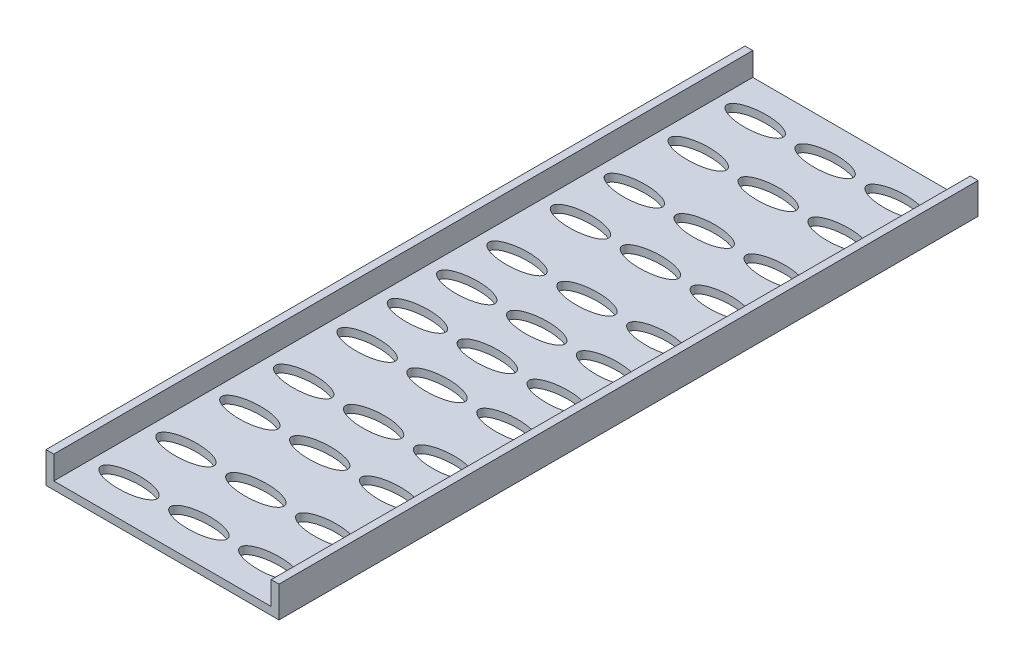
ISO-10303-21;
HEADER;
FILE_DESCRIPTION(('STEP AP214'),'2;1');
FILE_NAME('part.step','',(''),(''),'','','');
FILE_SCHEMA(('AUTOMOTIVE_DESIGN { 1 0 10303 214 1 1 1 1 }'));
ENDSEC;
DATA;
#1=APPLICATION_CONTEXT('core data for automotive mechanical design processes');
#2=APPLICATION_PROTOCOL_DEFINITION('international standard','automotive_design',2000,#1);
#3=PRODUCT_CONTEXT('',#1,'mechanical');
#4=PRODUCT('Part','Part','',(#3));
#5=PRODUCT_RELATED_PRODUCT_CATEGORY('part','',(#4));
#6=PRODUCT_DEFINITION_FORMATION('','',#4);
#7=PRODUCT_DEFINITION_CONTEXT('part definition',#1,'design');
#8=PRODUCT_DEFINITION('design','',#6,#7);
#9=PRODUCT_DEFINITION_SHAPE('','',#8);
#10=(LENGTH_UNIT() NAMED_UNIT(*) SI_UNIT(.MILLI.,.METRE.));
#11=(NAMED_UNIT(*) PLANE_ANGLE_UNIT() SI_UNIT($,.RADIAN.));
#12=(NAMED_UNIT(*) SI_UNIT($,.STERADIAN.) SOLID_ANGLE_UNIT());
#13=UNCERTAINTY_MEASURE_WITH_UNIT(LENGTH_MEASURE(1.E-05),#10,'distance_accuracy_value','');
#14=(GEOMETRIC_REPRESENTATION_CONTEXT(3) GLOBAL_UNCERTAINTY_ASSIGNED_CONTEXT((#13)) GLOBAL_UNIT_ASSIGNED_CONTEXT((#10,
#11,#12)) REPRESENTATION_CONTEXT('',''));
#15=CARTESIAN_POINT('',(0.,0.,0.));
#16=DIRECTION('',(0.,0.,1.));
#17=DIRECTION('',(1.,0.,0.));
#18=AXIS2_PLACEMENT_3D('',#15,#16,#17);
#19=CARTESIAN_POINT('',(0.,1.,0.));
#20=DIRECTION('',(0.,-1.,0.));
#21=DIRECTION('',(0.,0.,-1.));
#22=AXIS2_PLACEMENT_3D('',#19,#20,#21);
#23=PLANE('',#22);
#24=CARTESIAN_POINT('',(8.99999999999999,1.,-77.9822814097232));
#25=DIRECTION('',(0.,-1.,0.));
#26=DIRECTION('',(-1.,0.,0.));
#27=AXIS2_PLACEMENT_3D('',#24,#25,#26);
#28=ELLIPSE('',#27,3.63321962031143,1.38683764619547);
#29=CARTESIAN_POINT('',(5.36678037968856,1.,-77.9822814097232));
#30=VERTEX_POINT('',#29);
#31=EDGE_CURVE('E148',#30,#30,#28,.T.);
#32=ORIENTED_EDGE('',*,*,#31,.T.);
#33=EDGE_LOOP('',(#32));
#34=FACE_BOUND('',#33,.T.);
#35=CARTESIAN_POINT('',(0.,1.,-54.6513163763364));
#36=DIRECTION('',(0.,-1.,0.));
#37=DIRECTION('',(-1.,0.,0.));
#38=AXIS2_PLACEMENT_3D('',#35,#36,#37);
#39=ELLIPSE('',#38,3.63321962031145,1.38683764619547);
#40=CARTESIAN_POINT('',(-3.63321962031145,1.,-54.6513163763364));
#41=VERTEX_POINT('',#40);
#42=EDGE_CURVE('E289',#41,#41,#39,.T.);
#43=ORIENTED_EDGE('',*,*,#42,.T.);
#44=EDGE_LOOP('',(#43));
#45=FACE_BOUND('',#44,.T.);
#46=CARTESIAN_POINT('',(0.,1.,-85.3158376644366));
#47=DIRECTION('',(0.,-1.,0.));
#48=DIRECTION('',(-1.,0.,0.));
#49=AXIS2_PLACEMENT_3D('',#46,#47,#48);
#50=ELLIPSE('',#49,3.63321962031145,1.38683764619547);
#51=CARTESIAN_POINT('',(-3.63321962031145,1.,-85.3158376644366));
#52=VERTEX_POINT('',#51);
#53=EDGE_CURVE('E302',#52,#52,#50,.T.);
#54=ORIENTED_EDGE('',*,*,#53,.T.);
#55=EDGE_LOOP('',(#54));
#56=FACE_BOUND('',#55,.T.);
#57=CARTESIAN_POINT('',(0.,1.,-69.7524374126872));
#58=DIRECTION('',(0.,-1.,0.));
#59=DIRECTION('',(-1.,0.,0.));
#60=AXIS2_PLACEMENT_3D('',#57,#58,#59);
#61=ELLIPSE('',#60,3.63321962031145,1.38683764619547);
#62=CARTESIAN_POINT('',(-3.63321962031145,1.,-69.7524374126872));
#63=VERTEX_POINT('',#62);
#64=EDGE_CURVE('E325',#63,#63,#61,.T.);
#65=ORIENTED_EDGE('',*,*,#64,.T.);
#66=EDGE_LOOP('',(#65));
#67=FACE_BOUND('',#66,.T.);
#68=CARTESIAN_POINT('',(-8.99999999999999,1.,-85.3158376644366));
#69=DIRECTION('',(0.,1.,0.));
#70=DIRECTION('',(1.,0.,0.));
#71=AXIS2_PLACEMENT_3D('',#68,#69,#70);
#72=ELLIPSE('',#71,3.63321962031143,1.38683764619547);
#73=CARTESIAN_POINT('',(-5.36678037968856,1.,-85.3158376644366));
#74=VERTEX_POINT('',#73);
#75=EDGE_CURVE('E235',#74,#74,#72,.T.);
#76=ORIENTED_EDGE('',*,*,#75,.F.);
#77=EDGE_LOOP('',(#76));
#78=FACE_BOUND('',#77,.T.);
#79=CARTESIAN_POINT('',(-8.99999999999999,1.,-62.8182491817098));
#80=DIRECTION('',(0.,1.,0.));
#81=DIRECTION('',(1.,0.,0.));
#82=AXIS2_PLACEMENT_3D('',#79,#80,#81);
#83=ELLIPSE('',#82,3.63321962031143,1.38683764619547);
#84=CARTESIAN_POINT('',(-5.36678037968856,1.,-62.8182491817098));
#85=VERTEX_POINT('',#84);
#86=EDGE_CURVE('E259',#85,#85,#83,.T.);
#87=ORIENTED_EDGE('',*,*,#86,.F.);
#88=EDGE_LOOP('',(#87));
#89=FACE_BOUND('',#88,.T.);
#90=CARTESIAN_POINT('',(-8.99999999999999,1.,-48.1794073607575));
#91=DIRECTION('',(0.,1.,0.));
#92=DIRECTION('',(1.,0.,0.));
#93=AXIS2_PLACEMENT_3D('',#90,#91,#92);
#94=ELLIPSE('',#93,3.63321962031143,1.38683764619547);
#95=CARTESIAN_POINT('',(-5.36678037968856,1.,-48.1794073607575));
#96=VERTEX_POINT('',#95);
#97=EDGE_CURVE('E272',#96,#96,#94,.T.);
#98=ORIENTED_EDGE('',*,*,#97,.F.);
#99=EDGE_LOOP('',(#98));
#100=FACE_BOUND('',#99,.T.);
#101=CARTESIAN_POINT('',(-8.99999999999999,1.,-12.0177185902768));
#102=DIRECTION('',(0.,-1.,0.));
#103=DIRECTION('',(1.,0.,0.));
#104=AXIS2_PLACEMENT_3D('',#101,#102,#103);
#105=ELLIPSE('',#104,3.63321962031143,1.38683764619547);
#106=CARTESIAN_POINT('',(-5.36678037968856,1.,-12.0177185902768));
#107=VERTEX_POINT('',#106);
#108=EDGE_CURVE('E332',#107,#107,#105,.T.);
#109=ORIENTED_EDGE('',*,*,#108,.T.);
#110=EDGE_LOOP('',(#109));
#111=FACE_BOUND('',#110,.T.);
#112=CARTESIAN_POINT('',(0.,1.,-35.3486836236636));
#113=DIRECTION('',(0.,-1.,0.));
#114=DIRECTION('',(1.,0.,0.));
#115=AXIS2_PLACEMENT_3D('',#112,#113,#114);
#116=ELLIPSE('',#115,3.63321962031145,1.38683764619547);
#117=CARTESIAN_POINT('',(3.63321962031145,1.,-35.3486836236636));
#118=VERTEX_POINT('',#117);
#119=EDGE_CURVE('E455',#118,#118,#116,.T.);
#120=ORIENTED_EDGE('',*,*,#119,.T.);
#121=EDGE_LOOP('',(#120));
#122=FACE_BOUND('',#121,.T.);
#123=CARTESIAN_POINT('',(0.,1.,-4.6841623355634));
#124=DIRECTION('',(0.,-1.,0.));
#125=DIRECTION('',(1.,0.,0.));
#126=AXIS2_PLACEMENT_3D('',#123,#124,#125);
#127=ELLIPSE('',#126,3.63321962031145,1.38683764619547);
#128=CARTESIAN_POINT('',(3.63321962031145,1.,-4.6841623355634));
#129=VERTEX_POINT('',#128);
#130=EDGE_CURVE('E477',#129,#129,#127,.T.);
#131=ORIENTED_EDGE('',*,*,#130,.T.);
#132=EDGE_LOOP('',(#131));
#133=FACE_BOUND('',#132,.T.);
#134=CARTESIAN_POINT('',(0.,1.,-20.2475625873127));
#135=DIRECTION('',(0.,-1.,0.));
#136=DIRECTION('',(1.,0.,0.));
#137=AXIS2_PLACEMENT_3D('',#134,#135,#136);
#138=ELLIPSE('',#137,3.63321962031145,1.38683764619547);
#139=CARTESIAN_POINT('',(3.63321962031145,1.,-20.2475625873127));
#140=VERTEX_POINT('',#139);
#141=EDGE_CURVE('E504',#140,#140,#138,.T.);
#142=ORIENTED_EDGE('',*,*,#141,.T.);
#143=EDGE_LOOP('',(#142));
#144=FACE_BOUND('',#143,.T.);
#145=CARTESIAN_POINT('',(8.99999999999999,1.,-4.6841623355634));
#146=DIRECTION('',(0.,1.,0.));
#147=DIRECTION('',(-1.,0.,0.));
#148=AXIS2_PLACEMENT_3D('',#145,#146,#147);
#149=ELLIPSE('',#148,3.63321962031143,1.38683764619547);
#150=CARTESIAN_POINT('',(5.36678037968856,1.,-4.6841623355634));
#151=VERTEX_POINT('',#150);
#152=EDGE_CURVE('E418',#151,#151,#149,.T.);
#153=ORIENTED_EDGE('',*,*,#152,.F.);
#154=EDGE_LOOP('',(#153));
#155=FACE_BOUND('',#154,.T.);
#156=CARTESIAN_POINT('',(8.99999999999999,1.,-27.1817508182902));
#157=DIRECTION('',(0.,1.,0.));
#158=DIRECTION('',(-1.,0.,0.));
#159=AXIS2_PLACEMENT_3D('',#156,#157,#158);
#160=ELLIPSE('',#159,3.63321962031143,1.38683764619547);
#161=CARTESIAN_POINT('',(5.36678037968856,1.,-27.1817508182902));
#162=VERTEX_POINT('',#161);
#163=EDGE_CURVE('E425',#162,#162,#160,.T.);
#164=ORIENTED_EDGE('',*,*,#163,.F.);
#165=EDGE_LOOP('',(#164));
#166=FACE_BOUND('',#165,.T.);
#167=CARTESIAN_POINT('',(8.99999999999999,1.,-41.8205926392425));
#168=DIRECTION('',(0.,1.,0.));
#169=DIRECTION('',(-1.,0.,0.));
#170=AXIS2_PLACEMENT_3D('',#167,#168,#169);
#171=ELLIPSE('',#170,3.63321962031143,1.38683764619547);
#172=CARTESIAN_POINT('',(5.36678037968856,1.,-41.8205926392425));
#173=VERTEX_POINT('',#172);
#174=EDGE_CURVE('E447',#173,#173,#171,.T.);
#175=ORIENTED_EDGE('',*,*,#174,.F.);
#176=EDGE_LOOP('',(#175));
#177=FACE_BOUND('',#176,.T.);
#178=DIRECTION('',(1.,0.,0.));
#179=VECTOR('',#178,1.);
#180=CARTESIAN_POINT('',(-15.,1.,0.));
#181=LINE('',#180,#179);
#182=CARTESIAN_POINT('',(-14.,1.,0.));
#183=VERTEX_POINT('',#182);
#184=CARTESIAN_POINT('',(14.,1.,0.));
#185=VERTEX_POINT('',#184);
#186=EDGE_CURVE('E51',#183,#185,#181,.T.);
#187=ORIENTED_EDGE('',*,*,#186,.T.);
#188=DIRECTION('',(0.,0.,-1.));
#189=VECTOR('',#188,1.);
#190=CARTESIAN_POINT('',(14.,1.,0.));
#191=LINE('',#190,#189);
#192=CARTESIAN_POINT('',(14.,1.,-90.));
#193=VERTEX_POINT('',#192);
#194=EDGE_CURVE('E106',#185,#193,#191,.T.);
#195=ORIENTED_EDGE('',*,*,#194,.T.);
#196=DIRECTION('',(-1.,0.,0.));
#197=VECTOR('',#196,1.);
#198=CARTESIAN_POINT('',(-15.,1.,-90.));
#199=LINE('',#198,#197);
#200=CARTESIAN_POINT('',(-14.,1.,-90.));
#201=VERTEX_POINT('',#200);
#202=EDGE_CURVE('E513',#193,#201,#199,.T.);
#203=ORIENTED_EDGE('',*,*,#202,.T.);
#204=DIRECTION('',(0.,0.,1.));
#205=VECTOR('',#204,1.);
#206=CARTESIAN_POINT('',(-14.,1.,0.));
#207=LINE('',#206,#205);
#208=EDGE_CURVE('E56',#201,#183,#207,.T.);
#209=ORIENTED_EDGE('',*,*,#208,.T.);
#210=EDGE_LOOP('',(#187,#195,#203,#209));
#211=FACE_BOUND('',#210,.T.);
#212=CARTESIAN_POINT('',(8.99999999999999,1.,-35.3486836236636));
#213=DIRECTION('',(0.,1.,0.));
#214=DIRECTION('',(-1.,0.,0.));
#215=AXIS2_PLACEMENT_3D('',#212,#213,#214);
#216=ELLIPSE('',#215,3.63321962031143,1.38683764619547);
#217=CARTESIAN_POINT('',(5.36678037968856,1.,-35.3486836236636));
#218=VERTEX_POINT('',#217);
#219=EDGE_CURVE('E448',#218,#218,#216,.T.);
#220=ORIENTED_EDGE('',*,*,#219,.F.);
#221=EDGE_LOOP('',(#220));
#222=FACE_BOUND('',#221,.T.);
#223=CARTESIAN_POINT('',(8.99999999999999,1.,-20.2475625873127));
#224=DIRECTION('',(0.,1.,0.));
#225=DIRECTION('',(-1.,0.,0.));
#226=AXIS2_PLACEMENT_3D('',#223,#224,#225);
#227=ELLIPSE('',#226,3.63321962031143,1.38683764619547);
#228=CARTESIAN_POINT('',(5.36678037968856,1.,-20.2475625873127));
#229=VERTEX_POINT('',#228);
#230=EDGE_CURVE('E417',#229,#229,#227,.T.);
#231=ORIENTED_EDGE('',*,*,#230,.F.);
#232=EDGE_LOOP('',(#231));
#233=FACE_BOUND('',#232,.T.);
#234=CARTESIAN_POINT('',(8.99999999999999,1.,-12.0177185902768));
#235=DIRECTION('',(0.,1.,0.));
#236=DIRECTION('',(-1.,0.,0.));
#237=AXIS2_PLACEMENT_3D('',#234,#235,#236);
#238=ELLIPSE('',#237,3.63321962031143,1.38683764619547);
#239=CARTESIAN_POINT('',(5.36678037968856,1.,-12.0177185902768));
#240=VERTEX_POINT('',#239);
#241=EDGE_CURVE('E389',#240,#240,#238,.T.);
#242=ORIENTED_EDGE('',*,*,#241,.F.);
#243=EDGE_LOOP('',(#242));
#244=FACE_BOUND('',#243,.T.);
#245=CARTESIAN_POINT('',(0.,1.,-12.0177185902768));
#246=DIRECTION('',(0.,-1.,0.));
#247=DIRECTION('',(1.,0.,0.));
#248=AXIS2_PLACEMENT_3D('',#245,#246,#247);
#249=ELLIPSE('',#248,3.63321962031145,1.38683764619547);
#250=CARTESIAN_POINT('',(3.63321962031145,1.,-12.0177185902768));
#251=VERTEX_POINT('',#250);
#252=EDGE_CURVE('E485',#251,#251,#249,.T.);
#253=ORIENTED_EDGE('',*,*,#252,.T.);
#254=EDGE_LOOP('',(#253));
#255=FACE_BOUND('',#254,.T.);
#256=CARTESIAN_POINT('',(0.,1.,-27.1817508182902));
#257=DIRECTION('',(0.,-1.,0.));
#258=DIRECTION('',(1.,0.,0.));
#259=AXIS2_PLACEMENT_3D('',#256,#257,#258);
#260=ELLIPSE('',#259,3.63321962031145,1.38683764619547);
#261=CARTESIAN_POINT('',(3.63321962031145,1.,-27.1817508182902));
#262=VERTEX_POINT('',#261);
#263=EDGE_CURVE('E478',#262,#262,#260,.T.);
#264=ORIENTED_EDGE('',*,*,#263,.T.);
#265=EDGE_LOOP('',(#264));
#266=FACE_BOUND('',#265,.T.);
#267=CARTESIAN_POINT('',(-8.99999999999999,1.,-41.8205926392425));
#268=DIRECTION('',(0.,-1.,0.));
#269=DIRECTION('',(1.,0.,0.));
#270=AXIS2_PLACEMENT_3D('',#267,#268,#269);
#271=ELLIPSE('',#270,3.63321962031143,1.38683764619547);
#272=CARTESIAN_POINT('',(-5.36678037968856,1.,-41.8205926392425));
#273=VERTEX_POINT('',#272);
#274=EDGE_CURVE('E385',#273,#273,#271,.T.);
#275=ORIENTED_EDGE('',*,*,#274,.T.);
#276=EDGE_LOOP('',(#275));
#277=FACE_BOUND('',#276,.T.);
#278=CARTESIAN_POINT('',(-8.99999999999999,1.,-35.3486836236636));
#279=DIRECTION('',(0.,-1.,0.));
#280=DIRECTION('',(1.,0.,0.));
#281=AXIS2_PLACEMENT_3D('',#278,#279,#280);
#282=ELLIPSE('',#281,3.63321962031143,1.38683764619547);
#283=CARTESIAN_POINT('',(-5.36678037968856,1.,-35.3486836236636));
#284=VERTEX_POINT('',#283);
#285=EDGE_CURVE('E379',#284,#284,#282,.T.);
#286=ORIENTED_EDGE('',*,*,#285,.T.);
#287=EDGE_LOOP('',(#286));
#288=FACE_BOUND('',#287,.T.);
#289=CARTESIAN_POINT('',(-8.99999999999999,1.,-27.1817508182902));
#290=DIRECTION('',(0.,-1.,0.));
#291=DIRECTION('',(1.,0.,0.));
#292=AXIS2_PLACEMENT_3D('',#289,#290,#291);
#293=ELLIPSE('',#292,3.63321962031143,1.38683764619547);
#294=CARTESIAN_POINT('',(-5.36678037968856,1.,-27.1817508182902));
#295=VERTEX_POINT('',#294);
#296=EDGE_CURVE('E362',#295,#295,#293,.T.);
#297=ORIENTED_EDGE('',*,*,#296,.T.);
#298=EDGE_LOOP('',(#297));
#299=FACE_BOUND('',#298,.T.);
#300=CARTESIAN_POINT('',(-8.99999999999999,1.,-20.2475625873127));
#301=DIRECTION('',(0.,-1.,0.));
#302=DIRECTION('',(1.,0.,0.));
#303=AXIS2_PLACEMENT_3D('',#300,#301,#302);
#304=ELLIPSE('',#303,3.63321962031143,1.38683764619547);
#305=CARTESIAN_POINT('',(-5.36678037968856,1.,-20.2475625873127));
#306=VERTEX_POINT('',#305);
#307=EDGE_CURVE('E355',#306,#306,#304,.T.);
#308=ORIENTED_EDGE('',*,*,#307,.T.);
#309=EDGE_LOOP('',(#308));
#310=FACE_BOUND('',#309,.T.);
#311=CARTESIAN_POINT('',(-8.99999999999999,1.,-4.6841623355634));
#312=DIRECTION('',(0.,-1.,0.));
#313=DIRECTION('',(1.,0.,0.));
#314=AXIS2_PLACEMENT_3D('',#311,#312,#313);
#315=ELLIPSE('',#314,3.63321962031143,1.38683764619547);
#316=CARTESIAN_POINT('',(-5.36678037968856,1.,-4.6841623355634));
#317=VERTEX_POINT('',#316);
#318=EDGE_CURVE('E349',#317,#317,#315,.T.);
#319=ORIENTED_EDGE('',*,*,#318,.T.);
#320=EDGE_LOOP('',(#319));
#321=FACE_BOUND('',#320,.T.);
#322=CARTESIAN_POINT('',(0.,1.,-41.8205926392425));
#323=DIRECTION('',(0.,-1.,0.));
#324=DIRECTION('',(1.,0.,0.));
#325=AXIS2_PLACEMENT_3D('',#322,#323,#324);
#326=ELLIPSE('',#325,3.63321962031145,1.38683764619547);
#327=CARTESIAN_POINT('',(3.63321962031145,1.,-41.8205926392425));
#328=VERTEX_POINT('',#327);
#329=EDGE_CURVE('E395',#328,#328,#326,.T.);
#330=ORIENTED_EDGE('',*,*,#329,.T.);
#331=EDGE_LOOP('',(#330));
#332=FACE_BOUND('',#331,.T.);
#333=CARTESIAN_POINT('',(-8.99999999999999,1.,-54.6513163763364));
#334=DIRECTION('',(0.,1.,0.));
#335=DIRECTION('',(1.,0.,0.));
#336=AXIS2_PLACEMENT_3D('',#333,#334,#335);
#337=ELLIPSE('',#336,3.63321962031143,1.38683764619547);
#338=CARTESIAN_POINT('',(-5.36678037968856,1.,-54.6513163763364));
#339=VERTEX_POINT('',#338);
#340=EDGE_CURVE('E265',#339,#339,#337,.T.);
#341=ORIENTED_EDGE('',*,*,#340,.F.);
#342=EDGE_LOOP('',(#341));
#343=FACE_BOUND('',#342,.T.);
#344=CARTESIAN_POINT('',(-8.99999999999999,1.,-69.7524374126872));
#345=DIRECTION('',(0.,1.,0.));
#346=DIRECTION('',(1.,0.,0.));
#347=AXIS2_PLACEMENT_3D('',#344,#345,#346);
#348=ELLIPSE('',#347,3.63321962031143,1.38683764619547);
#349=CARTESIAN_POINT('',(-5.36678037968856,1.,-69.7524374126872));
#350=VERTEX_POINT('',#349);
#351=EDGE_CURVE('E242',#350,#350,#348,.T.);
#352=ORIENTED_EDGE('',*,*,#351,.F.);
#353=EDGE_LOOP('',(#352));
#354=FACE_BOUND('',#353,.T.);
#355=CARTESIAN_POINT('',(-8.99999999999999,1.,-77.9822814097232));
#356=DIRECTION('',(0.,1.,0.));
#357=DIRECTION('',(1.,0.,0.));
#358=AXIS2_PLACEMENT_3D('',#355,#356,#357);
#359=ELLIPSE('',#358,3.63321962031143,1.38683764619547);
#360=CARTESIAN_POINT('',(-5.36678037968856,1.,-77.9822814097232));
#361=VERTEX_POINT('',#360);
#362=EDGE_CURVE('E212',#361,#361,#359,.T.);
#363=ORIENTED_EDGE('',*,*,#362,.F.);
#364=EDGE_LOOP('',(#363));
#365=FACE_BOUND('',#364,.T.);
#366=CARTESIAN_POINT('',(0.,1.,-77.9822814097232));
#367=DIRECTION('',(0.,-1.,0.));
#368=DIRECTION('',(-1.,0.,0.));
#369=AXIS2_PLACEMENT_3D('',#366,#367,#368);
#370=ELLIPSE('',#369,3.63321962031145,1.38683764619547);
#371=CARTESIAN_POINT('',(-3.63321962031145,1.,-77.9822814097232));
#372=VERTEX_POINT('',#371);
#373=EDGE_CURVE('E319',#372,#372,#370,.T.);
#374=ORIENTED_EDGE('',*,*,#373,.T.);
#375=EDGE_LOOP('',(#374));
#376=FACE_BOUND('',#375,.T.);
#377=CARTESIAN_POINT('',(0.,1.,-62.8182491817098));
#378=DIRECTION('',(0.,-1.,0.));
#379=DIRECTION('',(-1.,0.,0.));
#380=AXIS2_PLACEMENT_3D('',#377,#378,#379);
#381=ELLIPSE('',#380,3.63321962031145,1.38683764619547);
#382=CARTESIAN_POINT('',(-3.63321962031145,1.,-62.8182491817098));
#383=VERTEX_POINT('',#382);
#384=EDGE_CURVE('E295',#383,#383,#381,.T.);
#385=ORIENTED_EDGE('',*,*,#384,.T.);
#386=EDGE_LOOP('',(#385));
#387=FACE_BOUND('',#386,.T.);
#388=CARTESIAN_POINT('',(8.99999999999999,1.,-48.1794073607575));
#389=DIRECTION('',(0.,-1.,0.));
#390=DIRECTION('',(-1.,0.,0.));
#391=AXIS2_PLACEMENT_3D('',#388,#389,#390);
#392=ELLIPSE('',#391,3.63321962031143,1.38683764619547);
#393=CARTESIAN_POINT('',(5.36678037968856,1.,-48.1794073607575));
#394=VERTEX_POINT('',#393);
#395=EDGE_CURVE('E205',#394,#394,#392,.T.);
#396=ORIENTED_EDGE('',*,*,#395,.T.);
#397=EDGE_LOOP('',(#396));
#398=FACE_BOUND('',#397,.T.);
#399=CARTESIAN_POINT('',(8.99999999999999,1.,-54.6513163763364));
#400=DIRECTION('',(0.,-1.,0.));
#401=DIRECTION('',(-1.,0.,0.));
#402=AXIS2_PLACEMENT_3D('',#399,#400,#401);
#403=ELLIPSE('',#402,3.63321962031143,1.38683764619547);
#404=CARTESIAN_POINT('',(5.36678037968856,1.,-54.6513163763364));
#405=VERTEX_POINT('',#404);
#406=EDGE_CURVE('E199',#405,#405,#403,.T.);
#407=ORIENTED_EDGE('',*,*,#406,.T.);
#408=EDGE_LOOP('',(#407));
#409=FACE_BOUND('',#408,.T.);
#410=CARTESIAN_POINT('',(8.99999999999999,1.,-62.8182491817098));
#411=DIRECTION('',(0.,-1.,0.));
#412=DIRECTION('',(-1.,0.,0.));
#413=AXIS2_PLACEMENT_3D('',#410,#411,#412);
#414=ELLIPSE('',#413,3.63321962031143,1.38683764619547);
#415=CARTESIAN_POINT('',(5.36678037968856,1.,-62.8182491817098));
#416=VERTEX_POINT('',#415);
#417=EDGE_CURVE('E182',#416,#416,#414,.T.);
#418=ORIENTED_EDGE('',*,*,#417,.T.);
#419=EDGE_LOOP('',(#418));
#420=FACE_BOUND('',#419,.T.);
#421=CARTESIAN_POINT('',(8.99999999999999,1.,-69.7524374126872));
#422=DIRECTION('',(0.,-1.,0.));
#423=DIRECTION('',(-1.,0.,0.));
#424=AXIS2_PLACEMENT_3D('',#421,#422,#423);
#425=ELLIPSE('',#424,3.63321962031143,1.38683764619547);
#426=CARTESIAN_POINT('',(5.36678037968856,1.,-69.7524374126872));
#427=VERTEX_POINT('',#426);
#428=EDGE_CURVE('E175',#427,#427,#425,.T.);
#429=ORIENTED_EDGE('',*,*,#428,.T.);
#430=EDGE_LOOP('',(#429));
#431=FACE_BOUND('',#430,.T.);
#432=CARTESIAN_POINT('',(8.99999999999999,1.,-85.3158376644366));
#433=DIRECTION('',(0.,-1.,0.));
#434=DIRECTION('',(-1.,0.,0.));
#435=AXIS2_PLACEMENT_3D('',#432,#433,#434);
#436=ELLIPSE('',#435,3.63321962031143,1.38683764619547);
#437=CARTESIAN_POINT('',(5.36678037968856,1.,-85.3158376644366));
#438=VERTEX_POINT('',#437);
#439=EDGE_CURVE('E169',#438,#438,#436,.T.);
#440=ORIENTED_EDGE('',*,*,#439,.T.);
#441=EDGE_LOOP('',(#440));
#442=FACE_BOUND('',#441,.T.);
#443=CARTESIAN_POINT('',(0.,1.,-48.1794073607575));
#444=DIRECTION('',(0.,-1.,0.));
#445=DIRECTION('',(-1.,0.,0.));
#446=AXIS2_PLACEMENT_3D('',#443,#444,#445);
#447=ELLIPSE('',#446,3.63321962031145,1.38683764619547);
#448=CARTESIAN_POINT('',(-3.63321962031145,1.,-48.1794073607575));
#449=VERTEX_POINT('',#448);
#450=EDGE_CURVE('E229',#449,#449,#447,.T.);
#451=ORIENTED_EDGE('',*,*,#450,.T.);
#452=EDGE_LOOP('',(#451));
#453=FACE_BOUND('',#452,.T.);
#454=ADVANCED_FACE('F36',(#34,#45,#56,#67,#78,#89,#100,#111,#122,#133,#144,#155,#166,#177,#211,
#222,#233,#244,#255,#266,#277,#288,#299,#310,#321,#332,#343,#354,#365,#376,#387,#398,#409,#420,
#431,#442,#453),#23,.F.);
#455=CARTESIAN_POINT('',(0.,0.,0.));
#456=DIRECTION('',(0.,-1.,0.));
#457=DIRECTION('',(0.,0.,-1.));
#458=AXIS2_PLACEMENT_3D('',#455,#456,#457);
#459=PLANE('',#458);
#460=CARTESIAN_POINT('',(8.99999999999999,0.,-77.9822814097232));
#461=DIRECTION('',(0.,-1.,0.));
#462=DIRECTION('',(-1.,0.,0.));
#463=AXIS2_PLACEMENT_3D('',#460,#461,#462);
#464=ELLIPSE('',#463,3.63321962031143,1.38683764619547);
#465=CARTESIAN_POINT('',(5.36678037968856,0.,-77.9822814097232));
#466=VERTEX_POINT('',#465);
#467=EDGE_CURVE('E147',#466,#466,#464,.T.);
#468=ORIENTED_EDGE('',*,*,#467,.F.);
#469=EDGE_LOOP('',(#468));
#470=FACE_BOUND('',#469,.T.);
#471=CARTESIAN_POINT('',(0.,0.,-54.6513163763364));
#472=DIRECTION('',(0.,-1.,0.));
#473=DIRECTION('',(-1.,0.,0.));
#474=AXIS2_PLACEMENT_3D('',#471,#472,#473);
#475=ELLIPSE('',#474,3.63321962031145,1.38683764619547);
#476=CARTESIAN_POINT('',(-3.63321962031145,0.,-54.6513163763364));
#477=VERTEX_POINT('',#476);
#478=EDGE_CURVE('E276',#477,#477,#475,.T.);
#479=ORIENTED_EDGE('',*,*,#478,.F.);
#480=EDGE_LOOP('',(#479));
#481=FACE_BOUND('',#480,.T.);
#482=CARTESIAN_POINT('',(0.,0.,-85.3158376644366));
#483=DIRECTION('',(0.,-1.,0.));
#484=DIRECTION('',(-1.,0.,0.));
#485=AXIS2_PLACEMENT_3D('',#482,#483,#484);
#486=ELLIPSE('',#485,3.63321962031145,1.38683764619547);
#487=CARTESIAN_POINT('',(-3.63321962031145,0.,-85.3158376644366));
#488=VERTEX_POINT('',#487);
#489=EDGE_CURVE('E299',#488,#488,#486,.T.);
#490=ORIENTED_EDGE('',*,*,#489,.F.);
#491=EDGE_LOOP('',(#490));
#492=FACE_BOUND('',#491,.T.);
#493=CARTESIAN_POINT('',(0.,0.,-69.7524374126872));
#494=DIRECTION('',(0.,-1.,0.));
#495=DIRECTION('',(-1.,0.,0.));
#496=AXIS2_PLACEMENT_3D('',#493,#494,#495);
#497=ELLIPSE('',#496,3.63321962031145,1.38683764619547);
#498=CARTESIAN_POINT('',(-3.63321962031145,0.,-69.7524374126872));
#499=VERTEX_POINT('',#498);
#500=EDGE_CURVE('E323',#499,#499,#497,.T.);
#501=ORIENTED_EDGE('',*,*,#500,.F.);
#502=EDGE_LOOP('',(#501));
#503=FACE_BOUND('',#502,.T.);
#504=CARTESIAN_POINT('',(-8.99999999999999,0.,-85.3158376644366));
#505=DIRECTION('',(0.,1.,0.));
#506=DIRECTION('',(1.,0.,0.));
#507=AXIS2_PLACEMENT_3D('',#504,#505,#506);
#508=ELLIPSE('',#507,3.63321962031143,1.38683764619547);
#509=CARTESIAN_POINT('',(-5.36678037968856,0.,-85.3158376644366));
#510=VERTEX_POINT('',#509);
#511=EDGE_CURVE('E233',#510,#510,#508,.T.);
#512=ORIENTED_EDGE('',*,*,#511,.T.);
#513=EDGE_LOOP('',(#512));
#514=FACE_BOUND('',#513,.T.);
#515=CARTESIAN_POINT('',(-8.99999999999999,0.,-62.8182491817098));
#516=DIRECTION('',(0.,1.,0.));
#517=DIRECTION('',(1.,0.,0.));
#518=AXIS2_PLACEMENT_3D('',#515,#516,#517);
#519=ELLIPSE('',#518,3.63321962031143,1.38683764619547);
#520=CARTESIAN_POINT('',(-5.36678037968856,0.,-62.8182491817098));
#521=VERTEX_POINT('',#520);
#522=EDGE_CURVE('E246',#521,#521,#519,.T.);
#523=ORIENTED_EDGE('',*,*,#522,.T.);
#524=EDGE_LOOP('',(#523));
#525=FACE_BOUND('',#524,.T.);
#526=CARTESIAN_POINT('',(-8.99999999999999,0.,-48.1794073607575));
#527=DIRECTION('',(0.,1.,0.));
#528=DIRECTION('',(1.,0.,0.));
#529=AXIS2_PLACEMENT_3D('',#526,#527,#528);
#530=ELLIPSE('',#529,3.63321962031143,1.38683764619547);
#531=CARTESIAN_POINT('',(-5.36678037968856,0.,-48.1794073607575));
#532=VERTEX_POINT('',#531);
#533=EDGE_CURVE('E269',#532,#532,#530,.T.);
#534=ORIENTED_EDGE('',*,*,#533,.T.);
#535=EDGE_LOOP('',(#534));
#536=FACE_BOUND('',#535,.T.);
#537=CARTESIAN_POINT('',(-8.99999999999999,0.,-12.0177185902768));
#538=DIRECTION('',(0.,-1.,0.));
#539=DIRECTION('',(1.,0.,0.));
#540=AXIS2_PLACEMENT_3D('',#537,#538,#539);
#541=ELLIPSE('',#540,3.63321962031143,1.38683764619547);
#542=CARTESIAN_POINT('',(-5.36678037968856,0.,-12.0177185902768));
#543=VERTEX_POINT('',#542);
#544=EDGE_CURVE('E329',#543,#543,#541,.T.);
#545=ORIENTED_EDGE('',*,*,#544,.F.);
#546=EDGE_LOOP('',(#545));
#547=FACE_BOUND('',#546,.T.);
#548=CARTESIAN_POINT('',(0.,0.,-35.3486836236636));
#549=DIRECTION('',(0.,-1.,0.));
#550=DIRECTION('',(1.,0.,0.));
#551=AXIS2_PLACEMENT_3D('',#548,#549,#550);
#552=ELLIPSE('',#551,3.63321962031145,1.38683764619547);
#553=CARTESIAN_POINT('',(3.63321962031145,0.,-35.3486836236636));
#554=VERTEX_POINT('',#553);
#555=EDGE_CURVE('E459',#554,#554,#552,.T.);
#556=ORIENTED_EDGE('',*,*,#555,.F.);
#557=EDGE_LOOP('',(#556));
#558=FACE_BOUND('',#557,.T.);
#559=CARTESIAN_POINT('',(0.,0.,-4.6841623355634));
#560=DIRECTION('',(0.,-1.,0.));
#561=DIRECTION('',(1.,0.,0.));
#562=AXIS2_PLACEMENT_3D('',#559,#560,#561);
#563=ELLIPSE('',#562,3.63321962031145,1.38683764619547);
#564=CARTESIAN_POINT('',(3.63321962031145,0.,-4.6841623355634));
#565=VERTEX_POINT('',#564);
#566=EDGE_CURVE('E482',#565,#565,#563,.T.);
#567=ORIENTED_EDGE('',*,*,#566,.F.);
#568=EDGE_LOOP('',(#567));
#569=FACE_BOUND('',#568,.T.);
#570=CARTESIAN_POINT('',(0.,0.,-20.2475625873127));
#571=DIRECTION('',(0.,-1.,0.));
#572=DIRECTION('',(1.,0.,0.));
#573=AXIS2_PLACEMENT_3D('',#570,#571,#572);
#574=ELLIPSE('',#573,3.63321962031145,1.38683764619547);
#575=CARTESIAN_POINT('',(3.63321962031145,0.,-20.2475625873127));
#576=VERTEX_POINT('',#575);
#577=EDGE_CURVE('E509',#576,#576,#574,.T.);
#578=ORIENTED_EDGE('',*,*,#577,.F.);
#579=EDGE_LOOP('',(#578));
#580=FACE_BOUND('',#579,.T.);
#581=CARTESIAN_POINT('',(8.99999999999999,0.,-4.6841623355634));
#582=DIRECTION('',(0.,1.,0.));
#583=DIRECTION('',(-1.,0.,0.));
#584=AXIS2_PLACEMENT_3D('',#581,#582,#583);
#585=ELLIPSE('',#584,3.63321962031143,1.38683764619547);
#586=CARTESIAN_POINT('',(5.36678037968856,0.,-4.6841623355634));
#587=VERTEX_POINT('',#586);
#588=EDGE_CURVE('E415',#587,#587,#585,.T.);
#589=ORIENTED_EDGE('',*,*,#588,.T.);
#590=EDGE_LOOP('',(#589));
#591=FACE_BOUND('',#590,.T.);
#592=CARTESIAN_POINT('',(8.99999999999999,0.,-27.1817508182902));
#593=DIRECTION('',(0.,1.,0.));
#594=DIRECTION('',(-1.,0.,0.));
#595=AXIS2_PLACEMENT_3D('',#592,#593,#594);
#596=ELLIPSE('',#595,3.63321962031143,1.38683764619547);
#597=CARTESIAN_POINT('',(5.36678037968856,0.,-27.1817508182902));
#598=VERTEX_POINT('',#597);
#599=EDGE_CURVE('E429',#598,#598,#596,.T.);
#600=ORIENTED_EDGE('',*,*,#599,.T.);
#601=EDGE_LOOP('',(#600));
#602=FACE_BOUND('',#601,.T.);
#603=CARTESIAN_POINT('',(8.99999999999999,0.,-41.8205926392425));
#604=DIRECTION('',(0.,1.,0.));
#605=DIRECTION('',(-1.,0.,0.));
#606=AXIS2_PLACEMENT_3D('',#603,#604,#605);
#607=ELLIPSE('',#606,3.63321962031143,1.38683764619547);
#608=CARTESIAN_POINT('',(5.36678037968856,0.,-41.8205926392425));
#609=VERTEX_POINT('',#608);
#610=EDGE_CURVE('E452',#609,#609,#607,.T.);
#611=ORIENTED_EDGE('',*,*,#610,.T.);
#612=EDGE_LOOP('',(#611));
#613=FACE_BOUND('',#612,.T.);
#614=DIRECTION('',(0.,0.,1.));
#615=VECTOR('',#614,1.);
#616=CARTESIAN_POINT('',(-15.,0.,0.));
#617=LINE('',#616,#615);
#618=CARTESIAN_POINT('',(-15.,0.,-90.));
#619=VERTEX_POINT('',#618);
#620=CARTESIAN_POINT('',(-15.,0.,0.));
#621=VERTEX_POINT('',#620);
#622=EDGE_CURVE('E508',#619,#621,#617,.T.);
#623=ORIENTED_EDGE('',*,*,#622,.F.);
#624=DIRECTION('',(-1.,0.,0.));
#625=VECTOR('',#624,1.);
#626=CARTESIAN_POINT('',(-15.,0.,-90.));
#627=LINE('',#626,#625);
#628=CARTESIAN_POINT('',(15.,0.,-90.));
#629=VERTEX_POINT('',#628);
#630=EDGE_CURVE('E514',#629,#619,#627,.T.);
#631=ORIENTED_EDGE('',*,*,#630,.F.);
#632=DIRECTION('',(0.,0.,-1.));
#633=VECTOR('',#632,1.);
#634=CARTESIAN_POINT('',(15.,0.,0.));
#635=LINE('',#634,#633);
#636=CARTESIAN_POINT('',(15.,0.,0.));
#637=VERTEX_POINT('',#636);
#638=EDGE_CURVE('E521',#637,#629,#635,.T.);
#639=ORIENTED_EDGE('',*,*,#638,.F.);
#640=DIRECTION('',(1.,0.,0.));
#641=VECTOR('',#640,1.);
#642=CARTESIAN_POINT('',(-15.,0.,0.));
#643=LINE('',#642,#641);
#644=EDGE_CURVE('E519',#621,#637,#643,.T.);
#645=ORIENTED_EDGE('',*,*,#644,.F.);
#646=EDGE_LOOP('',(#623,#631,#639,#645));
#647=FACE_BOUND('',#646,.T.);
#648=CARTESIAN_POINT('',(8.99999999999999,0.,-35.3486836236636));
#649=DIRECTION('',(0.,1.,0.));
#650=DIRECTION('',(-1.,0.,0.));
#651=AXIS2_PLACEMENT_3D('',#648,#649,#650);
#652=ELLIPSE('',#651,3.63321962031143,1.38683764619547);
#653=CARTESIAN_POINT('',(5.36678037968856,0.,-35.3486836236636));
#654=VERTEX_POINT('',#653);
#655=EDGE_CURVE('E445',#654,#654,#652,.T.);
#656=ORIENTED_EDGE('',*,*,#655,.T.);
#657=EDGE_LOOP('',(#656));
#658=FACE_BOUND('',#657,.T.);
#659=CARTESIAN_POINT('',(8.99999999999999,0.,-20.2475625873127));
#660=DIRECTION('',(0.,1.,0.));
#661=DIRECTION('',(-1.,0.,0.));
#662=AXIS2_PLACEMENT_3D('',#659,#660,#661);
#663=ELLIPSE('',#662,3.63321962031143,1.38683764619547);
#664=CARTESIAN_POINT('',(5.36678037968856,0.,-20.2475625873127));
#665=VERTEX_POINT('',#664);
#666=EDGE_CURVE('E422',#665,#665,#663,.T.);
#667=ORIENTED_EDGE('',*,*,#666,.T.);
#668=EDGE_LOOP('',(#667));
#669=FACE_BOUND('',#668,.T.);
#670=CARTESIAN_POINT('',(8.99999999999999,0.,-12.0177185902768));
#671=DIRECTION('',(0.,1.,0.));
#672=DIRECTION('',(-1.,0.,0.));
#673=AXIS2_PLACEMENT_3D('',#670,#671,#672);
#674=ELLIPSE('',#673,3.63321962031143,1.38683764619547);
#675=CARTESIAN_POINT('',(5.36678037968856,0.,-12.0177185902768));
#676=VERTEX_POINT('',#675);
#677=EDGE_CURVE('E392',#676,#676,#674,.T.);
#678=ORIENTED_EDGE('',*,*,#677,.T.);
#679=EDGE_LOOP('',(#678));
#680=FACE_BOUND('',#679,.T.);
#681=CARTESIAN_POINT('',(0.,0.,-12.0177185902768));
#682=DIRECTION('',(0.,-1.,0.));
#683=DIRECTION('',(1.,0.,0.));
#684=AXIS2_PLACEMENT_3D('',#681,#682,#683);
#685=ELLIPSE('',#684,3.63321962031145,1.38683764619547);
#686=CARTESIAN_POINT('',(3.63321962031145,0.,-12.0177185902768));
#687=VERTEX_POINT('',#686);
#688=EDGE_CURVE('E489',#687,#687,#685,.T.);
#689=ORIENTED_EDGE('',*,*,#688,.F.);
#690=EDGE_LOOP('',(#689));
#691=FACE_BOUND('',#690,.T.);
#692=CARTESIAN_POINT('',(0.,0.,-27.1817508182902));
#693=DIRECTION('',(0.,-1.,0.));
#694=DIRECTION('',(1.,0.,0.));
#695=AXIS2_PLACEMENT_3D('',#692,#693,#694);
#696=ELLIPSE('',#695,3.63321962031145,1.38683764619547);
#697=CARTESIAN_POINT('',(3.63321962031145,0.,-27.1817508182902));
#698=VERTEX_POINT('',#697);
#699=EDGE_CURVE('E475',#698,#698,#696,.T.);
#700=ORIENTED_EDGE('',*,*,#699,.F.);
#701=EDGE_LOOP('',(#700));
#702=FACE_BOUND('',#701,.T.);
#703=CARTESIAN_POINT('',(-8.99999999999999,0.,-41.8205926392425));
#704=DIRECTION('',(0.,-1.,0.));
#705=DIRECTION('',(1.,0.,0.));
#706=AXIS2_PLACEMENT_3D('',#703,#704,#705);
#707=ELLIPSE('',#706,3.63321962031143,1.38683764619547);
#708=CARTESIAN_POINT('',(-5.36678037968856,0.,-41.8205926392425));
#709=VERTEX_POINT('',#708);
#710=EDGE_CURVE('E383',#709,#709,#707,.T.);
#711=ORIENTED_EDGE('',*,*,#710,.F.);
#712=EDGE_LOOP('',(#711));
#713=FACE_BOUND('',#712,.T.);
#714=CARTESIAN_POINT('',(-8.99999999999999,0.,-35.3486836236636));
#715=DIRECTION('',(0.,-1.,0.));
#716=DIRECTION('',(1.,0.,0.));
#717=AXIS2_PLACEMENT_3D('',#714,#715,#716);
#718=ELLIPSE('',#717,3.63321962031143,1.38683764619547);
#719=CARTESIAN_POINT('',(-5.36678037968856,0.,-35.3486836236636));
#720=VERTEX_POINT('',#719);
#721=EDGE_CURVE('E366',#720,#720,#718,.T.);
#722=ORIENTED_EDGE('',*,*,#721,.F.);
#723=EDGE_LOOP('',(#722));
#724=FACE_BOUND('',#723,.T.);
#725=CARTESIAN_POINT('',(-8.99999999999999,0.,-27.1817508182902));
#726=DIRECTION('',(0.,-1.,0.));
#727=DIRECTION('',(1.,0.,0.));
#728=AXIS2_PLACEMENT_3D('',#725,#726,#727);
#729=ELLIPSE('',#728,3.63321962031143,1.38683764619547);
#730=CARTESIAN_POINT('',(-5.36678037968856,0.,-27.1817508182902));
#731=VERTEX_POINT('',#730);
#732=EDGE_CURVE('E359',#731,#731,#729,.T.);
#733=ORIENTED_EDGE('',*,*,#732,.F.);
#734=EDGE_LOOP('',(#733));
#735=FACE_BOUND('',#734,.T.);
#736=CARTESIAN_POINT('',(-8.99999999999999,0.,-20.2475625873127));
#737=DIRECTION('',(0.,-1.,0.));
#738=DIRECTION('',(1.,0.,0.));
#739=AXIS2_PLACEMENT_3D('',#736,#737,#738);
#740=ELLIPSE('',#739,3.63321962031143,1.38683764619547);
#741=CARTESIAN_POINT('',(-5.36678037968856,0.,-20.2475625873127));
#742=VERTEX_POINT('',#741);
#743=EDGE_CURVE('E353',#742,#742,#740,.T.);
#744=ORIENTED_EDGE('',*,*,#743,.F.);
#745=EDGE_LOOP('',(#744));
#746=FACE_BOUND('',#745,.T.);
#747=CARTESIAN_POINT('',(-8.99999999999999,0.,-4.6841623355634));
#748=DIRECTION('',(0.,-1.,0.));
#749=DIRECTION('',(1.,0.,0.));
#750=AXIS2_PLACEMENT_3D('',#747,#748,#749);
#751=ELLIPSE('',#750,3.63321962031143,1.38683764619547);
#752=CARTESIAN_POINT('',(-5.36678037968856,0.,-4.6841623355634));
#753=VERTEX_POINT('',#752);
#754=EDGE_CURVE('E336',#753,#753,#751,.T.);
#755=ORIENTED_EDGE('',*,*,#754,.F.);
#756=EDGE_LOOP('',(#755));
#757=FACE_BOUND('',#756,.T.);
#758=CARTESIAN_POINT('',(0.,0.,-41.8205926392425));
#759=DIRECTION('',(0.,-1.,0.));
#760=DIRECTION('',(1.,0.,0.));
#761=AXIS2_PLACEMENT_3D('',#758,#759,#760);
#762=ELLIPSE('',#761,3.63321962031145,1.38683764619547);
#763=CARTESIAN_POINT('',(3.63321962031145,0.,-41.8205926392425));
#764=VERTEX_POINT('',#763);
#765=EDGE_CURVE('E399',#764,#764,#762,.T.);
#766=ORIENTED_EDGE('',*,*,#765,.F.);
#767=EDGE_LOOP('',(#766));
#768=FACE_BOUND('',#767,.T.);
#769=CARTESIAN_POINT('',(-8.99999999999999,0.,-54.6513163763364));
#770=DIRECTION('',(0.,1.,0.));
#771=DIRECTION('',(1.,0.,0.));
#772=AXIS2_PLACEMENT_3D('',#769,#770,#771);
#773=ELLIPSE('',#772,3.63321962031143,1.38683764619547);
#774=CARTESIAN_POINT('',(-5.36678037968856,0.,-54.6513163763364));
#775=VERTEX_POINT('',#774);
#776=EDGE_CURVE('E263',#775,#775,#773,.T.);
#777=ORIENTED_EDGE('',*,*,#776,.T.);
#778=EDGE_LOOP('',(#777));
#779=FACE_BOUND('',#778,.T.);
#780=CARTESIAN_POINT('',(-8.99999999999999,0.,-69.7524374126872));
#781=DIRECTION('',(0.,1.,0.));
#782=DIRECTION('',(1.,0.,0.));
#783=AXIS2_PLACEMENT_3D('',#780,#781,#782);
#784=ELLIPSE('',#783,3.63321962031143,1.38683764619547);
#785=CARTESIAN_POINT('',(-5.36678037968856,0.,-69.7524374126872));
#786=VERTEX_POINT('',#785);
#787=EDGE_CURVE('E239',#786,#786,#784,.T.);
#788=ORIENTED_EDGE('',*,*,#787,.T.);
#789=EDGE_LOOP('',(#788));
#790=FACE_BOUND('',#789,.T.);
#791=CARTESIAN_POINT('',(-8.99999999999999,0.,-77.9822814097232));
#792=DIRECTION('',(0.,1.,0.));
#793=DIRECTION('',(1.,0.,0.));
#794=AXIS2_PLACEMENT_3D('',#791,#792,#793);
#795=ELLIPSE('',#794,3.63321962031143,1.38683764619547);
#796=CARTESIAN_POINT('',(-5.36678037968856,0.,-77.9822814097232));
#797=VERTEX_POINT('',#796);
#798=EDGE_CURVE('E209',#797,#797,#795,.T.);
#799=ORIENTED_EDGE('',*,*,#798,.T.);
#800=EDGE_LOOP('',(#799));
#801=FACE_BOUND('',#800,.T.);
#802=CARTESIAN_POINT('',(0.,0.,-77.9822814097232));
#803=DIRECTION('',(0.,-1.,0.));
#804=DIRECTION('',(-1.,0.,0.));
#805=AXIS2_PLACEMENT_3D('',#802,#803,#804);
#806=ELLIPSE('',#805,3.63321962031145,1.38683764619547);
#807=CARTESIAN_POINT('',(-3.63321962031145,0.,-77.9822814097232));
#808=VERTEX_POINT('',#807);
#809=EDGE_CURVE('E306',#808,#808,#806,.T.);
#810=ORIENTED_EDGE('',*,*,#809,.F.);
#811=EDGE_LOOP('',(#810));
#812=FACE_BOUND('',#811,.T.);
#813=CARTESIAN_POINT('',(0.,0.,-62.8182491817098));
#814=DIRECTION('',(0.,-1.,0.));
#815=DIRECTION('',(-1.,0.,0.));
#816=AXIS2_PLACEMENT_3D('',#813,#814,#815);
#817=ELLIPSE('',#816,3.63321962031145,1.38683764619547);
#818=CARTESIAN_POINT('',(-3.63321962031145,0.,-62.8182491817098));
#819=VERTEX_POINT('',#818);
#820=EDGE_CURVE('E293',#819,#819,#817,.T.);
#821=ORIENTED_EDGE('',*,*,#820,.F.);
#822=EDGE_LOOP('',(#821));
#823=FACE_BOUND('',#822,.T.);
#824=CARTESIAN_POINT('',(8.99999999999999,0.,-48.1794073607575));
#825=DIRECTION('',(0.,-1.,0.));
#826=DIRECTION('',(-1.,0.,0.));
#827=AXIS2_PLACEMENT_3D('',#824,#825,#826);
#828=ELLIPSE('',#827,3.63321962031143,1.38683764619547);
#829=CARTESIAN_POINT('',(5.36678037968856,0.,-48.1794073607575));
#830=VERTEX_POINT('',#829);
#831=EDGE_CURVE('E203',#830,#830,#828,.T.);
#832=ORIENTED_EDGE('',*,*,#831,.F.);
#833=EDGE_LOOP('',(#832));
#834=FACE_BOUND('',#833,.T.);
#835=CARTESIAN_POINT('',(8.99999999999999,0.,-54.6513163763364));
#836=DIRECTION('',(0.,-1.,0.));
#837=DIRECTION('',(-1.,0.,0.));
#838=AXIS2_PLACEMENT_3D('',#835,#836,#837);
#839=ELLIPSE('',#838,3.63321962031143,1.38683764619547);
#840=CARTESIAN_POINT('',(5.36678037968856,0.,-54.6513163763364));
#841=VERTEX_POINT('',#840);
#842=EDGE_CURVE('E186',#841,#841,#839,.T.);
#843=ORIENTED_EDGE('',*,*,#842,.F.);
#844=EDGE_LOOP('',(#843));
#845=FACE_BOUND('',#844,.T.);
#846=CARTESIAN_POINT('',(8.99999999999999,0.,-62.8182491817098));
#847=DIRECTION('',(0.,-1.,0.));
#848=DIRECTION('',(-1.,0.,0.));
#849=AXIS2_PLACEMENT_3D('',#846,#847,#848);
#850=ELLIPSE('',#849,3.63321962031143,1.38683764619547);
#851=CARTESIAN_POINT('',(5.36678037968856,0.,-62.8182491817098));
#852=VERTEX_POINT('',#851);
#853=EDGE_CURVE('E179',#852,#852,#850,.T.);
#854=ORIENTED_EDGE('',*,*,#853,.F.);
#855=EDGE_LOOP('',(#854));
#856=FACE_BOUND('',#855,.T.);
#857=CARTESIAN_POINT('',(8.99999999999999,0.,-69.7524374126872));
#858=DIRECTION('',(0.,-1.,0.));
#859=DIRECTION('',(-1.,0.,0.));
#860=AXIS2_PLACEMENT_3D('',#857,#858,#859);
#861=ELLIPSE('',#860,3.63321962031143,1.38683764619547);
#862=CARTESIAN_POINT('',(5.36678037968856,0.,-69.7524374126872));
#863=VERTEX_POINT('',#862);
#864=EDGE_CURVE('E173',#863,#863,#861,.T.);
#865=ORIENTED_EDGE('',*,*,#864,.F.);
#866=EDGE_LOOP('',(#865));
#867=FACE_BOUND('',#866,.T.);
#868=CARTESIAN_POINT('',(8.99999999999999,0.,-85.3158376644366));
#869=DIRECTION('',(0.,-1.,0.));
#870=DIRECTION('',(-1.,0.,0.));
#871=AXIS2_PLACEMENT_3D('',#868,#869,#870);
#872=ELLIPSE('',#871,3.63321962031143,1.38683764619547);
#873=CARTESIAN_POINT('',(5.36678037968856,0.,-85.3158376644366));
#874=VERTEX_POINT('',#873);
#875=EDGE_CURVE('E152',#874,#874,#872,.T.);
#876=ORIENTED_EDGE('',*,*,#875,.F.);
#877=EDGE_LOOP('',(#876));
#878=FACE_BOUND('',#877,.T.);
#879=CARTESIAN_POINT('',(0.,0.,-48.1794073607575));
#880=DIRECTION('',(0.,-1.,0.));
#881=DIRECTION('',(-1.,0.,0.));
#882=AXIS2_PLACEMENT_3D('',#879,#880,#881);
#883=ELLIPSE('',#882,3.63321962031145,1.38683764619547);
#884=CARTESIAN_POINT('',(-3.63321962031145,0.,-48.1794073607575));
#885=VERTEX_POINT('',#884);
#886=EDGE_CURVE('E216',#885,#885,#883,.T.);
#887=ORIENTED_EDGE('',*,*,#886,.F.);
#888=EDGE_LOOP('',(#887));
#889=FACE_BOUND('',#888,.T.);
#890=ADVANCED_FACE('F534',(#470,#481,#492,#503,#514,#525,#536,#547,#558,#569,#580,#591,#602,
#613,#647,#658,#669,#680,#691,#702,#713,#724,#735,#746,#757,#768,#779,#790,#801,#812,#823,#834,
#845,#856,#867,#878,#889),#459,.T.);
#891=CARTESIAN_POINT('',(-15.,1.,0.));
#892=DIRECTION('',(1.,0.,0.));
#893=DIRECTION('',(0.,0.,-1.));
#894=AXIS2_PLACEMENT_3D('',#891,#892,#893);
#895=PLANE('',#894);
#896=ORIENTED_EDGE('',*,*,#622,.T.);
#897=DIRECTION('',(0.,-1.,0.));
#898=VECTOR('',#897,1.);
#899=CARTESIAN_POINT('',(-15.,1.,0.));
#900=LINE('',#899,#898);
#901=CARTESIAN_POINT('',(-15.,4.,0.));
#902=VERTEX_POINT('',#901);
#903=EDGE_CURVE('E11',#902,#621,#900,.T.);
#904=ORIENTED_EDGE('',*,*,#903,.F.);
#905=DIRECTION('',(0.,0.,1.));
#906=VECTOR('',#905,1.);
#907=CARTESIAN_POINT('',(-15.,4.,0.));
#908=LINE('',#907,#906);
#909=CARTESIAN_POINT('',(-15.,4.,-90.));
#910=VERTEX_POINT('',#909);
#911=EDGE_CURVE('E135',#910,#902,#908,.T.);
#912=ORIENTED_EDGE('',*,*,#911,.F.);
#913=DIRECTION('',(0.,-1.,0.));
#914=VECTOR('',#913,1.);
#915=CARTESIAN_POINT('',(-15.,1.,-90.));
#916=LINE('',#915,#914);
#917=EDGE_CURVE('E516',#910,#619,#916,.T.);
#918=ORIENTED_EDGE('',*,*,#917,.T.);
#919=EDGE_LOOP('',(#896,#904,#912,#918));
#920=FACE_BOUND('',#919,.T.);
#921=ADVANCED_FACE('F38',(#920),#895,.F.);
#922=CARTESIAN_POINT('',(-15.,1.,0.));
#923=DIRECTION('',(0.,0.,-1.));
#924=DIRECTION('',(-1.,0.,0.));
#925=AXIS2_PLACEMENT_3D('',#922,#923,#924);
#926=PLANE('',#925);
#927=ORIENTED_EDGE('',*,*,#644,.T.);
#928=DIRECTION('',(0.,-1.,0.));
#929=VECTOR('',#928,1.);
#930=CARTESIAN_POINT('',(15.,1.,0.));
#931=LINE('',#930,#929);
#932=CARTESIAN_POINT('',(15.,4.,0.));
#933=VERTEX_POINT('',#932);
#934=EDGE_CURVE('E44',#933,#637,#931,.T.);
#935=ORIENTED_EDGE('',*,*,#934,.F.);
#936=DIRECTION('',(1.,0.,0.));
#937=VECTOR('',#936,1.);
#938=CARTESIAN_POINT('',(0.,4.,0.));
#939=LINE('',#938,#937);
#940=CARTESIAN_POINT('',(14.,4.,0.));
#941=VERTEX_POINT('',#940);
#942=EDGE_CURVE('E111',#941,#933,#939,.T.);
#943=ORIENTED_EDGE('',*,*,#942,.F.);
#944=DIRECTION('',(0.,-1.,0.));
#945=VECTOR('',#944,1.);
#946=CARTESIAN_POINT('',(14.,4.,0.));
#947=LINE('',#946,#945);
#948=EDGE_CURVE('E100',#941,#185,#947,.T.);
#949=ORIENTED_EDGE('',*,*,#948,.T.);
#950=ORIENTED_EDGE('',*,*,#186,.F.);
#951=DIRECTION('',(0.,-1.,0.));
#952=VECTOR('',#951,1.);
#953=CARTESIAN_POINT('',(-14.,4.,0.));
#954=LINE('',#953,#952);
#955=CARTESIAN_POINT('',(-14.,4.,0.));
#956=VERTEX_POINT('',#955);
#957=EDGE_CURVE('E140',#956,#183,#954,.T.);
#958=ORIENTED_EDGE('',*,*,#957,.F.);
#959=DIRECTION('',(1.,0.,0.));
#960=VECTOR('',#959,1.);
#961=CARTESIAN_POINT('',(0.,4.,0.));
#962=LINE('',#961,#960);
#963=EDGE_CURVE('E138',#902,#956,#962,.T.);
#964=ORIENTED_EDGE('',*,*,#963,.F.);
#965=ORIENTED_EDGE('',*,*,#903,.T.);
#966=EDGE_LOOP('',(#927,#935,#943,#949,#950,#958,#964,#965));
#967=FACE_BOUND('',#966,.T.);
#968=ADVANCED_FACE('F112',(#967),#926,.F.);
#969=CARTESIAN_POINT('',(15.,1.,0.));
#970=DIRECTION('',(-1.,0.,0.));
#971=DIRECTION('',(0.,0.,1.));
#972=AXIS2_PLACEMENT_3D('',#969,#970,#971);
#973=PLANE('',#972);
#974=ORIENTED_EDGE('',*,*,#638,.T.);
#975=DIRECTION('',(0.,-1.,0.));
#976=VECTOR('',#975,1.);
#977=CARTESIAN_POINT('',(15.,1.,-90.));
#978=LINE('',#977,#976);
#979=CARTESIAN_POINT('',(15.,4.,-90.));
#980=VERTEX_POINT('',#979);
#981=EDGE_CURVE('E526',#980,#629,#978,.T.);
#982=ORIENTED_EDGE('',*,*,#981,.F.);
#983=DIRECTION('',(0.,0.,-1.));
#984=VECTOR('',#983,1.);
#985=CARTESIAN_POINT('',(15.,4.,0.));
#986=LINE('',#985,#984);
#987=EDGE_CURVE('E117',#933,#980,#986,.T.);
#988=ORIENTED_EDGE('',*,*,#987,.F.);
#989=ORIENTED_EDGE('',*,*,#934,.T.);
#990=EDGE_LOOP('',(#974,#982,#988,#989));
#991=FACE_BOUND('',#990,.T.);
#992=ADVANCED_FACE('F530',(#991),#973,.F.);
#993=CARTESIAN_POINT('',(-15.,1.,-90.));
#994=DIRECTION('',(0.,0.,1.));
#995=DIRECTION('',(1.,0.,0.));
#996=AXIS2_PLACEMENT_3D('',#993,#994,#995);
#997=PLANE('',#996);
#998=ORIENTED_EDGE('',*,*,#630,.T.);
#999=ORIENTED_EDGE('',*,*,#917,.F.);
#1000=DIRECTION('',(-1.,0.,0.));
#1001=VECTOR('',#1000,1.);
#1002=CARTESIAN_POINT('',(0.,4.,-90.));
#1003=LINE('',#1002,#1001);
#1004=CARTESIAN_POINT('',(-14.,4.,-90.));
#1005=VERTEX_POINT('',#1004);
#1006=EDGE_CURVE('E132',#1005,#910,#1003,.T.);
#1007=ORIENTED_EDGE('',*,*,#1006,.F.);
#1008=DIRECTION('',(0.,-1.,0.));
#1009=VECTOR('',#1008,1.);
#1010=CARTESIAN_POINT('',(-14.,4.,-90.));
#1011=LINE('',#1010,#1009);
#1012=EDGE_CURVE('E144',#1005,#201,#1011,.T.);
#1013=ORIENTED_EDGE('',*,*,#1012,.T.);
#1014=ORIENTED_EDGE('',*,*,#202,.F.);
#1015=DIRECTION('',(0.,-1.,0.));
#1016=VECTOR('',#1015,1.);
#1017=CARTESIAN_POINT('',(14.,4.,-90.));
#1018=LINE('',#1017,#1016);
#1019=CARTESIAN_POINT('',(14.,4.,-90.));
#1020=VERTEX_POINT('',#1019);
#1021=EDGE_CURVE('E108',#1020,#193,#1018,.T.);
#1022=ORIENTED_EDGE('',*,*,#1021,.F.);
#1023=DIRECTION('',(-1.,0.,0.));
#1024=VECTOR('',#1023,1.);
#1025=CARTESIAN_POINT('',(0.,4.,-90.));
#1026=LINE('',#1025,#1024);
#1027=EDGE_CURVE('E121',#980,#1020,#1026,.T.);
#1028=ORIENTED_EDGE('',*,*,#1027,.F.);
#1029=ORIENTED_EDGE('',*,*,#981,.T.);
#1030=EDGE_LOOP('',(#998,#999,#1007,#1013,#1014,#1022,#1028,#1029));
#1031=FACE_BOUND('',#1030,.T.);
#1032=ADVANCED_FACE('F537',(#1031),#997,.F.);
#1033=DIRECTION('',(0.,-1.,0.));
#1034=VECTOR('',#1033,1.);
#1035=SURFACE_OF_LINEAR_EXTRUSION('',#138,#1034);
#1036=ORIENTED_EDGE('',*,*,#577,.T.);
#1037=EDGE_LOOP('',(#1036));
#1038=FACE_BOUND('',#1037,.T.);
#1039=ORIENTED_EDGE('',*,*,#141,.F.);
#1040=EDGE_LOOP('',(#1039));
#1041=FACE_BOUND('',#1040,.T.);
#1042=ADVANCED_FACE('F498',(#1038,#1041),#1035,.F.);
#1043=DIRECTION('',(0.,-1.,0.));
#1044=VECTOR('',#1043,1.);
#1045=SURFACE_OF_LINEAR_EXTRUSION('',#249,#1044);
#1046=ORIENTED_EDGE('',*,*,#688,.T.);
#1047=EDGE_LOOP('',(#1046));
#1048=FACE_BOUND('',#1047,.T.);
#1049=ORIENTED_EDGE('',*,*,#252,.F.);
#1050=EDGE_LOOP('',(#1049));
#1051=FACE_BOUND('',#1050,.T.);
#1052=ADVANCED_FACE('F494',(#1048,#1051),#1045,.F.);
#1053=DIRECTION('',(0.,-1.,0.));
#1054=VECTOR('',#1053,1.);
#1055=SURFACE_OF_LINEAR_EXTRUSION('',#127,#1054);
#1056=ORIENTED_EDGE('',*,*,#566,.T.);
#1057=EDGE_LOOP('',(#1056));
#1058=FACE_BOUND('',#1057,.T.);
#1059=ORIENTED_EDGE('',*,*,#130,.F.);
#1060=EDGE_LOOP('',(#1059));
#1061=FACE_BOUND('',#1060,.T.);
#1062=ADVANCED_FACE('F491',(#1058,#1061),#1055,.F.);
#1063=DIRECTION('',(0.,-1.,0.));
#1064=VECTOR('',#1063,1.);
#1065=SURFACE_OF_LINEAR_EXTRUSION('',#260,#1064);
#1066=ORIENTED_EDGE('',*,*,#699,.T.);
#1067=EDGE_LOOP('',(#1066));
#1068=FACE_BOUND('',#1067,.T.);
#1069=ORIENTED_EDGE('',*,*,#263,.F.);
#1070=EDGE_LOOP('',(#1069));
#1071=FACE_BOUND('',#1070,.T.);
#1072=ADVANCED_FACE('F468',(#1068,#1071),#1065,.F.);
#1073=DIRECTION('',(0.,-1.,0.));
#1074=VECTOR('',#1073,1.);
#1075=SURFACE_OF_LINEAR_EXTRUSION('',#116,#1074);
#1076=ORIENTED_EDGE('',*,*,#555,.T.);
#1077=EDGE_LOOP('',(#1076));
#1078=FACE_BOUND('',#1077,.T.);
#1079=ORIENTED_EDGE('',*,*,#119,.F.);
#1080=EDGE_LOOP('',(#1079));
#1081=FACE_BOUND('',#1080,.T.);
#1082=ADVANCED_FACE('F464',(#1078,#1081),#1075,.F.);
#1083=DIRECTION('',(0.,-1.,0.));
#1084=VECTOR('',#1083,1.);
#1085=SURFACE_OF_LINEAR_EXTRUSION('',#171,#1084);
#1086=ORIENTED_EDGE('',*,*,#174,.T.);
#1087=EDGE_LOOP('',(#1086));
#1088=FACE_BOUND('',#1087,.T.);
#1089=ORIENTED_EDGE('',*,*,#610,.F.);
#1090=EDGE_LOOP('',(#1089));
#1091=FACE_BOUND('',#1090,.T.);
#1092=ADVANCED_FACE('F461',(#1088,#1091),#1085,.T.);
#1093=DIRECTION('',(0.,-1.,0.));
#1094=VECTOR('',#1093,1.);
#1095=SURFACE_OF_LINEAR_EXTRUSION('',#216,#1094);
#1096=ORIENTED_EDGE('',*,*,#219,.T.);
#1097=EDGE_LOOP('',(#1096));
#1098=FACE_BOUND('',#1097,.T.);
#1099=ORIENTED_EDGE('',*,*,#655,.F.);
#1100=EDGE_LOOP('',(#1099));
#1101=FACE_BOUND('',#1100,.T.);
#1102=ADVANCED_FACE('F438',(#1098,#1101),#1095,.T.);
#1103=DIRECTION('',(0.,-1.,0.));
#1104=VECTOR('',#1103,1.);
#1105=SURFACE_OF_LINEAR_EXTRUSION('',#160,#1104);
#1106=ORIENTED_EDGE('',*,*,#163,.T.);
#1107=EDGE_LOOP('',(#1106));
#1108=FACE_BOUND('',#1107,.T.);
#1109=ORIENTED_EDGE('',*,*,#599,.F.);
#1110=EDGE_LOOP('',(#1109));
#1111=FACE_BOUND('',#1110,.T.);
#1112=ADVANCED_FACE('F434',(#1108,#1111),#1105,.T.);
#1113=DIRECTION('',(0.,-1.,0.));
#1114=VECTOR('',#1113,1.);
#1115=SURFACE_OF_LINEAR_EXTRUSION('',#227,#1114);
#1116=ORIENTED_EDGE('',*,*,#230,.T.);
#1117=EDGE_LOOP('',(#1116));
#1118=FACE_BOUND('',#1117,.T.);
#1119=ORIENTED_EDGE('',*,*,#666,.F.);
#1120=EDGE_LOOP('',(#1119));
#1121=FACE_BOUND('',#1120,.T.);
#1122=ADVANCED_FACE('F431',(#1118,#1121),#1115,.T.);
#1123=DIRECTION('',(0.,-1.,0.));
#1124=VECTOR('',#1123,1.);
#1125=SURFACE_OF_LINEAR_EXTRUSION('',#149,#1124);
#1126=ORIENTED_EDGE('',*,*,#152,.T.);
#1127=EDGE_LOOP('',(#1126));
#1128=FACE_BOUND('',#1127,.T.);
#1129=ORIENTED_EDGE('',*,*,#588,.F.);
#1130=EDGE_LOOP('',(#1129));
#1131=FACE_BOUND('',#1130,.T.);
#1132=ADVANCED_FACE('F408',(#1128,#1131),#1125,.T.);
#1133=DIRECTION('',(0.,-1.,0.));
#1134=VECTOR('',#1133,1.);
#1135=SURFACE_OF_LINEAR_EXTRUSION('',#326,#1134);
#1136=ORIENTED_EDGE('',*,*,#765,.T.);
#1137=EDGE_LOOP('',(#1136));
#1138=FACE_BOUND('',#1137,.T.);
#1139=ORIENTED_EDGE('',*,*,#329,.F.);
#1140=EDGE_LOOP('',(#1139));
#1141=FACE_BOUND('',#1140,.T.);
#1142=ADVANCED_FACE('F404',(#1138,#1141),#1135,.F.);
#1143=DIRECTION('',(0.,-1.,0.));
#1144=VECTOR('',#1143,1.);
#1145=SURFACE_OF_LINEAR_EXTRUSION('',#238,#1144);
#1146=ORIENTED_EDGE('',*,*,#241,.T.);
#1147=EDGE_LOOP('',(#1146));
#1148=FACE_BOUND('',#1147,.T.);
#1149=ORIENTED_EDGE('',*,*,#677,.F.);
#1150=EDGE_LOOP('',(#1149));
#1151=FACE_BOUND('',#1150,.T.);
#1152=ADVANCED_FACE('F401',(#1148,#1151),#1145,.T.);
#1153=DIRECTION('',(0.,-1.,0.));
#1154=VECTOR('',#1153,1.);
#1155=SURFACE_OF_LINEAR_EXTRUSION('',#271,#1154);
#1156=ORIENTED_EDGE('',*,*,#274,.F.);
#1157=EDGE_LOOP('',(#1156));
#1158=FACE_BOUND('',#1157,.T.);
#1159=ORIENTED_EDGE('',*,*,#710,.T.);
#1160=EDGE_LOOP('',(#1159));
#1161=FACE_BOUND('',#1160,.T.);
#1162=ADVANCED_FACE('F375',(#1158,#1161),#1155,.F.);
#1163=DIRECTION('',(0.,-1.,0.));
#1164=VECTOR('',#1163,1.);
#1165=SURFACE_OF_LINEAR_EXTRUSION('',#282,#1164);
#1166=ORIENTED_EDGE('',*,*,#285,.F.);
#1167=EDGE_LOOP('',(#1166));
#1168=FACE_BOUND('',#1167,.T.);
#1169=ORIENTED_EDGE('',*,*,#721,.T.);
#1170=EDGE_LOOP('',(#1169));
#1171=FACE_BOUND('',#1170,.T.);
#1172=ADVANCED_FACE('F371',(#1168,#1171),#1165,.F.);
#1173=DIRECTION('',(0.,-1.,0.));
#1174=VECTOR('',#1173,1.);
#1175=SURFACE_OF_LINEAR_EXTRUSION('',#293,#1174);
#1176=ORIENTED_EDGE('',*,*,#296,.F.);
#1177=EDGE_LOOP('',(#1176));
#1178=FACE_BOUND('',#1177,.T.);
#1179=ORIENTED_EDGE('',*,*,#732,.T.);
#1180=EDGE_LOOP('',(#1179));
#1181=FACE_BOUND('',#1180,.T.);
#1182=ADVANCED_FACE('F368',(#1178,#1181),#1175,.F.);
#1183=DIRECTION('',(0.,-1.,0.));
#1184=VECTOR('',#1183,1.);
#1185=SURFACE_OF_LINEAR_EXTRUSION('',#304,#1184);
#1186=ORIENTED_EDGE('',*,*,#307,.F.);
#1187=EDGE_LOOP('',(#1186));
#1188=FACE_BOUND('',#1187,.T.);
#1189=ORIENTED_EDGE('',*,*,#743,.T.);
#1190=EDGE_LOOP('',(#1189));
#1191=FACE_BOUND('',#1190,.T.);
#1192=ADVANCED_FACE('F345',(#1188,#1191),#1185,.F.);
#1193=DIRECTION('',(0.,-1.,0.));
#1194=VECTOR('',#1193,1.);
#1195=SURFACE_OF_LINEAR_EXTRUSION('',#315,#1194);
#1196=ORIENTED_EDGE('',*,*,#318,.F.);
#1197=EDGE_LOOP('',(#1196));
#1198=FACE_BOUND('',#1197,.T.);
#1199=ORIENTED_EDGE('',*,*,#754,.T.);
#1200=EDGE_LOOP('',(#1199));
#1201=FACE_BOUND('',#1200,.T.);
#1202=ADVANCED_FACE('F341',(#1198,#1201),#1195,.F.);
#1203=DIRECTION('',(0.,-1.,0.));
#1204=VECTOR('',#1203,1.);
#1205=SURFACE_OF_LINEAR_EXTRUSION('',#105,#1204);
#1206=ORIENTED_EDGE('',*,*,#108,.F.);
#1207=EDGE_LOOP('',(#1206));
#1208=FACE_BOUND('',#1207,.T.);
#1209=ORIENTED_EDGE('',*,*,#544,.T.);
#1210=EDGE_LOOP('',(#1209));
#1211=FACE_BOUND('',#1210,.T.);
#1212=ADVANCED_FACE('F338',(#1208,#1211),#1205,.F.);
#1213=DIRECTION('',(0.,-1.,0.));
#1214=VECTOR('',#1213,1.);
#1215=SURFACE_OF_LINEAR_EXTRUSION('',#61,#1214);
#1216=ORIENTED_EDGE('',*,*,#500,.T.);
#1217=EDGE_LOOP('',(#1216));
#1218=FACE_BOUND('',#1217,.T.);
#1219=ORIENTED_EDGE('',*,*,#64,.F.);
#1220=EDGE_LOOP('',(#1219));
#1221=FACE_BOUND('',#1220,.T.);
#1222=ADVANCED_FACE('F315',(#1218,#1221),#1215,.F.);
#1223=DIRECTION('',(0.,-1.,0.));
#1224=VECTOR('',#1223,1.);
#1225=SURFACE_OF_LINEAR_EXTRUSION('',#370,#1224);
#1226=ORIENTED_EDGE('',*,*,#809,.T.);
#1227=EDGE_LOOP('',(#1226));
#1228=FACE_BOUND('',#1227,.T.);
#1229=ORIENTED_EDGE('',*,*,#373,.F.);
#1230=EDGE_LOOP('',(#1229));
#1231=FACE_BOUND('',#1230,.T.);
#1232=ADVANCED_FACE('F311',(#1228,#1231),#1225,.F.);
#1233=DIRECTION('',(0.,-1.,0.));
#1234=VECTOR('',#1233,1.);
#1235=SURFACE_OF_LINEAR_EXTRUSION('',#50,#1234);
#1236=ORIENTED_EDGE('',*,*,#489,.T.);
#1237=EDGE_LOOP('',(#1236));
#1238=FACE_BOUND('',#1237,.T.);
#1239=ORIENTED_EDGE('',*,*,#53,.F.);
#1240=EDGE_LOOP('',(#1239));
#1241=FACE_BOUND('',#1240,.T.);
#1242=ADVANCED_FACE('F308',(#1238,#1241),#1235,.F.);
#1243=DIRECTION('',(0.,-1.,0.));
#1244=VECTOR('',#1243,1.);
#1245=SURFACE_OF_LINEAR_EXTRUSION('',#381,#1244);
#1246=ORIENTED_EDGE('',*,*,#820,.T.);
#1247=EDGE_LOOP('',(#1246));
#1248=FACE_BOUND('',#1247,.T.);
#1249=ORIENTED_EDGE('',*,*,#384,.F.);
#1250=EDGE_LOOP('',(#1249));
#1251=FACE_BOUND('',#1250,.T.);
#1252=ADVANCED_FACE('F285',(#1248,#1251),#1245,.F.);
#1253=DIRECTION('',(0.,-1.,0.));
#1254=VECTOR('',#1253,1.);
#1255=SURFACE_OF_LINEAR_EXTRUSION('',#39,#1254);
#1256=ORIENTED_EDGE('',*,*,#478,.T.);
#1257=EDGE_LOOP('',(#1256));
#1258=FACE_BOUND('',#1257,.T.);
#1259=ORIENTED_EDGE('',*,*,#42,.F.);
#1260=EDGE_LOOP('',(#1259));
#1261=FACE_BOUND('',#1260,.T.);
#1262=ADVANCED_FACE('F281',(#1258,#1261),#1255,.F.);
#1263=DIRECTION('',(0.,-1.,0.));
#1264=VECTOR('',#1263,1.);
#1265=SURFACE_OF_LINEAR_EXTRUSION('',#94,#1264);
#1266=ORIENTED_EDGE('',*,*,#97,.T.);
#1267=EDGE_LOOP('',(#1266));
#1268=FACE_BOUND('',#1267,.T.);
#1269=ORIENTED_EDGE('',*,*,#533,.F.);
#1270=EDGE_LOOP('',(#1269));
#1271=FACE_BOUND('',#1270,.T.);
#1272=ADVANCED_FACE('F278',(#1268,#1271),#1265,.T.);
#1273=DIRECTION('',(0.,-1.,0.));
#1274=VECTOR('',#1273,1.);
#1275=SURFACE_OF_LINEAR_EXTRUSION('',#337,#1274);
#1276=ORIENTED_EDGE('',*,*,#340,.T.);
#1277=EDGE_LOOP('',(#1276));
#1278=FACE_BOUND('',#1277,.T.);
#1279=ORIENTED_EDGE('',*,*,#776,.F.);
#1280=EDGE_LOOP('',(#1279));
#1281=FACE_BOUND('',#1280,.T.);
#1282=ADVANCED_FACE('F255',(#1278,#1281),#1275,.T.);
#1283=DIRECTION('',(0.,-1.,0.));
#1284=VECTOR('',#1283,1.);
#1285=SURFACE_OF_LINEAR_EXTRUSION('',#83,#1284);
#1286=ORIENTED_EDGE('',*,*,#86,.T.);
#1287=EDGE_LOOP('',(#1286));
#1288=FACE_BOUND('',#1287,.T.);
#1289=ORIENTED_EDGE('',*,*,#522,.F.);
#1290=EDGE_LOOP('',(#1289));
#1291=FACE_BOUND('',#1290,.T.);
#1292=ADVANCED_FACE('F251',(#1288,#1291),#1285,.T.);
#1293=DIRECTION('',(0.,-1.,0.));
#1294=VECTOR('',#1293,1.);
#1295=SURFACE_OF_LINEAR_EXTRUSION('',#348,#1294);
#1296=ORIENTED_EDGE('',*,*,#351,.T.);
#1297=EDGE_LOOP('',(#1296));
#1298=FACE_BOUND('',#1297,.T.);
#1299=ORIENTED_EDGE('',*,*,#787,.F.);
#1300=EDGE_LOOP('',(#1299));
#1301=FACE_BOUND('',#1300,.T.);
#1302=ADVANCED_FACE('F248',(#1298,#1301),#1295,.T.);
#1303=DIRECTION('',(0.,-1.,0.));
#1304=VECTOR('',#1303,1.);
#1305=SURFACE_OF_LINEAR_EXTRUSION('',#72,#1304);
#1306=ORIENTED_EDGE('',*,*,#75,.T.);
#1307=EDGE_LOOP('',(#1306));
#1308=FACE_BOUND('',#1307,.T.);
#1309=ORIENTED_EDGE('',*,*,#511,.F.);
#1310=EDGE_LOOP('',(#1309));
#1311=FACE_BOUND('',#1310,.T.);
#1312=ADVANCED_FACE('F225',(#1308,#1311),#1305,.T.);
#1313=DIRECTION('',(0.,-1.,0.));
#1314=VECTOR('',#1313,1.);
#1315=SURFACE_OF_LINEAR_EXTRUSION('',#447,#1314);
#1316=ORIENTED_EDGE('',*,*,#886,.T.);
#1317=EDGE_LOOP('',(#1316));
#1318=FACE_BOUND('',#1317,.T.);
#1319=ORIENTED_EDGE('',*,*,#450,.F.);
#1320=EDGE_LOOP('',(#1319));
#1321=FACE_BOUND('',#1320,.T.);
#1322=ADVANCED_FACE('F221',(#1318,#1321),#1315,.F.);
#1323=DIRECTION('',(0.,-1.,0.));
#1324=VECTOR('',#1323,1.);
#1325=SURFACE_OF_LINEAR_EXTRUSION('',#359,#1324);
#1326=ORIENTED_EDGE('',*,*,#362,.T.);
#1327=EDGE_LOOP('',(#1326));
#1328=FACE_BOUND('',#1327,.T.);
#1329=ORIENTED_EDGE('',*,*,#798,.F.);
#1330=EDGE_LOOP('',(#1329));
#1331=FACE_BOUND('',#1330,.T.);
#1332=ADVANCED_FACE('F218',(#1328,#1331),#1325,.T.);
#1333=DIRECTION('',(0.,-1.,0.));
#1334=VECTOR('',#1333,1.);
#1335=SURFACE_OF_LINEAR_EXTRUSION('',#392,#1334);
#1336=ORIENTED_EDGE('',*,*,#395,.F.);
#1337=EDGE_LOOP('',(#1336));
#1338=FACE_BOUND('',#1337,.T.);
#1339=ORIENTED_EDGE('',*,*,#831,.T.);
#1340=EDGE_LOOP('',(#1339));
#1341=FACE_BOUND('',#1340,.T.);
#1342=ADVANCED_FACE('F195',(#1338,#1341),#1335,.F.);
#1343=DIRECTION('',(0.,-1.,0.));
#1344=VECTOR('',#1343,1.);
#1345=SURFACE_OF_LINEAR_EXTRUSION('',#403,#1344);
#1346=ORIENTED_EDGE('',*,*,#406,.F.);
#1347=EDGE_LOOP('',(#1346));
#1348=FACE_BOUND('',#1347,.T.);
#1349=ORIENTED_EDGE('',*,*,#842,.T.);
#1350=EDGE_LOOP('',(#1349));
#1351=FACE_BOUND('',#1350,.T.);
#1352=ADVANCED_FACE('F191',(#1348,#1351),#1345,.F.);
#1353=DIRECTION('',(0.,-1.,0.));
#1354=VECTOR('',#1353,1.);
#1355=SURFACE_OF_LINEAR_EXTRUSION('',#414,#1354);
#1356=ORIENTED_EDGE('',*,*,#417,.F.);
#1357=EDGE_LOOP('',(#1356));
#1358=FACE_BOUND('',#1357,.T.);
#1359=ORIENTED_EDGE('',*,*,#853,.T.);
#1360=EDGE_LOOP('',(#1359));
#1361=FACE_BOUND('',#1360,.T.);
#1362=ADVANCED_FACE('F188',(#1358,#1361),#1355,.F.);
#1363=DIRECTION('',(0.,-1.,0.));
#1364=VECTOR('',#1363,1.);
#1365=SURFACE_OF_LINEAR_EXTRUSION('',#425,#1364);
#1366=ORIENTED_EDGE('',*,*,#428,.F.);
#1367=EDGE_LOOP('',(#1366));
#1368=FACE_BOUND('',#1367,.T.);
#1369=ORIENTED_EDGE('',*,*,#864,.T.);
#1370=EDGE_LOOP('',(#1369));
#1371=FACE_BOUND('',#1370,.T.);
#1372=ADVANCED_FACE('F165',(#1368,#1371),#1365,.F.);
#1373=DIRECTION('',(0.,-1.,0.));
#1374=VECTOR('',#1373,1.);
#1375=SURFACE_OF_LINEAR_EXTRUSION('',#436,#1374);
#1376=ORIENTED_EDGE('',*,*,#439,.F.);
#1377=EDGE_LOOP('',(#1376));
#1378=FACE_BOUND('',#1377,.T.);
#1379=ORIENTED_EDGE('',*,*,#875,.T.);
#1380=EDGE_LOOP('',(#1379));
#1381=FACE_BOUND('',#1380,.T.);
#1382=ADVANCED_FACE('F160',(#1378,#1381),#1375,.F.);
#1383=DIRECTION('',(0.,-1.,0.));
#1384=VECTOR('',#1383,1.);
#1385=SURFACE_OF_LINEAR_EXTRUSION('',#28,#1384);
#1386=ORIENTED_EDGE('',*,*,#31,.F.);
#1387=EDGE_LOOP('',(#1386));
#1388=FACE_BOUND('',#1387,.T.);
#1389=ORIENTED_EDGE('',*,*,#467,.T.);
#1390=EDGE_LOOP('',(#1389));
#1391=FACE_BOUND('',#1390,.T.);
#1392=ADVANCED_FACE('F155',(#1388,#1391),#1385,.F.);
#1393=CARTESIAN_POINT('',(-14.,4.,0.));
#1394=DIRECTION('',(1.,0.,0.));
#1395=DIRECTION('',(0.,0.,-1.));
#1396=AXIS2_PLACEMENT_3D('',#1393,#1394,#1395);
#1397=PLANE('',#1396);
#1398=ORIENTED_EDGE('',*,*,#208,.F.);
#1399=ORIENTED_EDGE('',*,*,#1012,.F.);
#1400=DIRECTION('',(0.,0.,1.));
#1401=VECTOR('',#1400,1.);
#1402=CARTESIAN_POINT('',(-14.,4.,0.));
#1403=LINE('',#1402,#1401);
#1404=EDGE_CURVE('E129',#1005,#956,#1403,.T.);
#1405=ORIENTED_EDGE('',*,*,#1404,.T.);
#1406=ORIENTED_EDGE('',*,*,#957,.T.);
#1407=EDGE_LOOP('',(#1398,#1399,#1405,#1406));
#1408=FACE_BOUND('',#1407,.T.);
#1409=ADVANCED_FACE('F159',(#1408),#1397,.T.);
#1410=CARTESIAN_POINT('',(0.,4.,0.));
#1411=DIRECTION('',(0.,1.,0.));
#1412=DIRECTION('',(0.,0.,1.));
#1413=AXIS2_PLACEMENT_3D('',#1410,#1411,#1412);
#1414=PLANE('',#1413);
#1415=ORIENTED_EDGE('',*,*,#1404,.F.);
#1416=ORIENTED_EDGE('',*,*,#1006,.T.);
#1417=ORIENTED_EDGE('',*,*,#911,.T.);
#1418=ORIENTED_EDGE('',*,*,#963,.T.);
#1419=EDGE_LOOP('',(#1415,#1416,#1417,#1418));
#1420=FACE_BOUND('',#1419,.T.);
#1421=ADVANCED_FACE('F544',(#1420),#1414,.T.);
#1422=CARTESIAN_POINT('',(14.,4.,0.));
#1423=DIRECTION('',(-1.,0.,0.));
#1424=DIRECTION('',(0.,0.,1.));
#1425=AXIS2_PLACEMENT_3D('',#1422,#1423,#1424);
#1426=PLANE('',#1425);
#1427=ORIENTED_EDGE('',*,*,#194,.F.);
#1428=ORIENTED_EDGE('',*,*,#948,.F.);
#1429=DIRECTION('',(0.,0.,-1.));
#1430=VECTOR('',#1429,1.);
#1431=CARTESIAN_POINT('',(14.,4.,0.));
#1432=LINE('',#1431,#1430);
#1433=EDGE_CURVE('E105',#941,#1020,#1432,.T.);
#1434=ORIENTED_EDGE('',*,*,#1433,.T.);
#1435=ORIENTED_EDGE('',*,*,#1021,.T.);
#1436=EDGE_LOOP('',(#1427,#1428,#1434,#1435));
#1437=FACE_BOUND('',#1436,.T.);
#1438=ADVANCED_FACE('F102',(#1437),#1426,.T.);
#1439=CARTESIAN_POINT('',(0.,4.,0.));
#1440=DIRECTION('',(0.,1.,0.));
#1441=DIRECTION('',(0.,0.,1.));
#1442=AXIS2_PLACEMENT_3D('',#1439,#1440,#1441);
#1443=PLANE('',#1442);
#1444=ORIENTED_EDGE('',*,*,#1433,.F.);
#1445=ORIENTED_EDGE('',*,*,#942,.T.);
#1446=ORIENTED_EDGE('',*,*,#987,.T.);
#1447=ORIENTED_EDGE('',*,*,#1027,.T.);
#1448=EDGE_LOOP('',(#1444,#1445,#1446,#1447));
#1449=FACE_BOUND('',#1448,.T.);
#1450=ADVANCED_FACE('F119',(#1449),#1443,.T.);
#1451=CLOSED_SHELL('',(#454,#890,#921,#968,#992,#1032,#1042,#1052,#1062,#1072,#1082,#1092,#1102,
#1112,#1122,#1132,#1142,#1152,#1162,#1172,#1182,#1192,#1202,#1212,#1222,#1232,#1242,#1252,#1262,
#1272,#1282,#1292,#1302,#1312,#1322,#1332,#1342,#1352,#1362,#1372,#1382,#1392,#1409,#1421,#1438,#1450));
#1452=MANIFOLD_SOLID_BREP('B2',#1451);
#1453=ADVANCED_BREP_SHAPE_REPRESENTATION('',(#18,#1452),#14);
#1454=SHAPE_DEFINITION_REPRESENTATION(#9,#1453);
ENDSEC;
END-ISO-10303-21;
